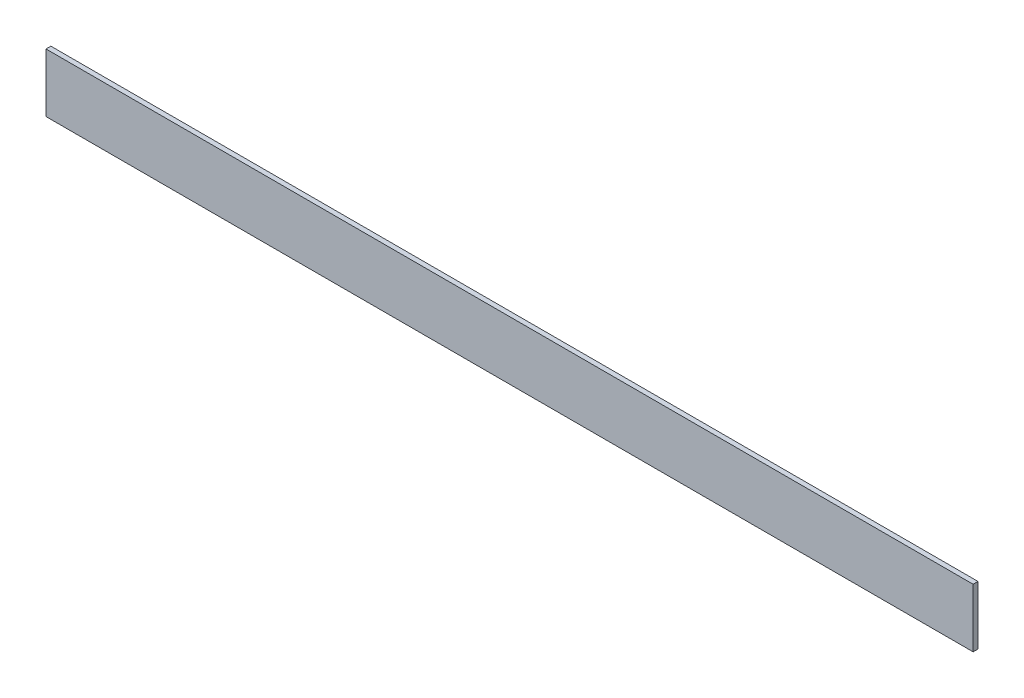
from build123d import *

# Parameters (mm, degrees)
SKETCH1_W           = 1206.5
SKETCH1_H           = 76.2
BOSS_EXTRUDE1_DEPTH = 6.35


with BuildPart() as part:
    # Sketch1 → Boss-Extrude1 (new body)
    with BuildSketch(Plane.XY):
        Rectangle(SKETCH1_W, SKETCH1_H)
    extrude(amount=BOSS_EXTRUDE1_DEPTH)


solid = part.part
